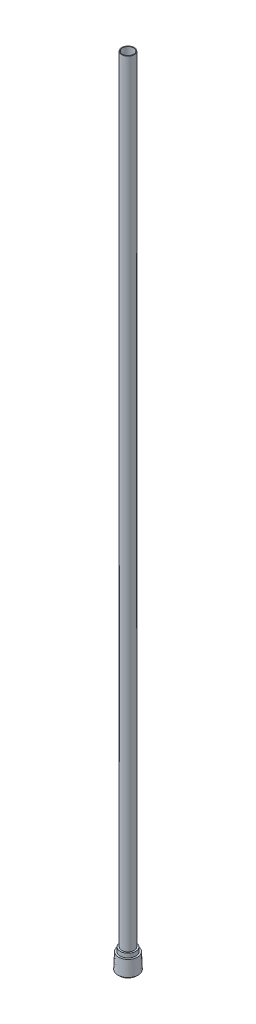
ISO-10303-21;
HEADER;
FILE_DESCRIPTION(('STEP AP214'),'2;1');
FILE_NAME('part.step','',(''),(''),'','','');
FILE_SCHEMA(('AUTOMOTIVE_DESIGN { 1 0 10303 214 1 1 1 1 }'));
ENDSEC;
DATA;
#1=APPLICATION_CONTEXT('core data for automotive mechanical design processes');
#2=APPLICATION_PROTOCOL_DEFINITION('international standard','automotive_design',2000,#1);
#3=PRODUCT_CONTEXT('',#1,'mechanical');
#4=PRODUCT('Part','Part','',(#3));
#5=PRODUCT_RELATED_PRODUCT_CATEGORY('part','',(#4));
#6=PRODUCT_DEFINITION_FORMATION('','',#4);
#7=PRODUCT_DEFINITION_CONTEXT('part definition',#1,'design');
#8=PRODUCT_DEFINITION('design','',#6,#7);
#9=PRODUCT_DEFINITION_SHAPE('','',#8);
#10=(LENGTH_UNIT() NAMED_UNIT(*) SI_UNIT(.MILLI.,.METRE.));
#11=(NAMED_UNIT(*) PLANE_ANGLE_UNIT() SI_UNIT($,.RADIAN.));
#12=(NAMED_UNIT(*) SI_UNIT($,.STERADIAN.) SOLID_ANGLE_UNIT());
#13=UNCERTAINTY_MEASURE_WITH_UNIT(LENGTH_MEASURE(1.E-05),#10,'distance_accuracy_value','');
#14=(GEOMETRIC_REPRESENTATION_CONTEXT(3) GLOBAL_UNCERTAINTY_ASSIGNED_CONTEXT((#13)) GLOBAL_UNIT_ASSIGNED_CONTEXT((#10,
#11,#12)) REPRESENTATION_CONTEXT('',''));
#15=CARTESIAN_POINT('',(0.,0.,0.));
#16=DIRECTION('',(0.,0.,1.));
#17=DIRECTION('',(1.,0.,0.));
#18=AXIS2_PLACEMENT_3D('',#15,#16,#17);
#19=CARTESIAN_POINT('',(0.,3.96240000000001,2.28769270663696));
#20=DIRECTION('',(0.,-1.,0.));
#21=DIRECTION('',(0.,0.,-1.));
#22=AXIS2_PLACEMENT_3D('',#19,#20,#21);
#23=PLANE('',#22);
#24=DIRECTION('',(0.866025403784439,0.,-0.5));
#25=VECTOR('',#24,1.);
#26=CARTESIAN_POINT('',(-1.9812,3.9624,-1.1438463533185));
#27=LINE('',#26,#25);
#28=CARTESIAN_POINT('',(-1.9812,3.9624,-1.1438463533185));
#29=VERTEX_POINT('',#28);
#30=CARTESIAN_POINT('',(-1.64618945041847,3.9624,-1.33726478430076));
#31=VERTEX_POINT('',#30);
#32=EDGE_CURVE('E143',#29,#31,#27,.T.);
#33=ORIENTED_EDGE('',*,*,#32,.T.);
#34=CARTESIAN_POINT('',(0.,3.9624,0.));
#35=DIRECTION('',(0.,-1.,0.));
#36=DIRECTION('',(0.,0.,-1.));
#37=AXIS2_PLACEMENT_3D('',#34,#35,#36);
#38=CIRCLE('',#37,2.1209);
#39=CARTESIAN_POINT('',(-1.9812,3.9624,-0.75700949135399));
#40=VERTEX_POINT('',#39);
#41=EDGE_CURVE('E124',#31,#40,#38,.F.);
#42=ORIENTED_EDGE('',*,*,#41,.T.);
#43=DIRECTION('',(0.,0.,-1.));
#44=VECTOR('',#43,1.);
#45=CARTESIAN_POINT('',(-1.9812,3.9624,1.14384635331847));
#46=LINE('',#45,#44);
#47=EDGE_CURVE('E147',#40,#29,#46,.T.);
#48=ORIENTED_EDGE('',*,*,#47,.T.);
#49=EDGE_LOOP('',(#33,#42,#48));
#50=FACE_BOUND('',#49,.T.);
#51=ADVANCED_FACE('F34',(#50),#23,.T.);
#52=CARTESIAN_POINT('',(-1.9812,3.9624,1.14384635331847));
#53=VERTEX_POINT('',#52);
#54=CARTESIAN_POINT('',(-1.9812,3.9624,0.75700949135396));
#55=VERTEX_POINT('',#54);
#56=EDGE_CURVE('E154',#53,#55,#46,.T.);
#57=ORIENTED_EDGE('',*,*,#56,.T.);
#58=CARTESIAN_POINT('',(-1.64618945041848,3.9624,1.33726478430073));
#59=VERTEX_POINT('',#58);
#60=EDGE_CURVE('E523',#55,#59,#38,.F.);
#61=ORIENTED_EDGE('',*,*,#60,.T.);
#62=DIRECTION('',(-0.866025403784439,0.,-0.5));
#63=VECTOR('',#62,1.);
#64=CARTESIAN_POINT('',(0.,3.96240000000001,2.28769270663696));
#65=LINE('',#64,#63);
#66=EDGE_CURVE('E166',#59,#53,#65,.T.);
#67=ORIENTED_EDGE('',*,*,#66,.T.);
#68=EDGE_LOOP('',(#57,#61,#67));
#69=FACE_BOUND('',#68,.T.);
#70=ADVANCED_FACE('F236',(#69),#23,.T.);
#71=CARTESIAN_POINT('',(0.,3.96240000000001,2.28769270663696));
#72=VERTEX_POINT('',#71);
#73=CARTESIAN_POINT('',(-0.33501054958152,3.96240000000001,2.0942742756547));
#74=VERTEX_POINT('',#73);
#75=EDGE_CURVE('E163',#72,#74,#65,.T.);
#76=ORIENTED_EDGE('',*,*,#75,.T.);
#77=CARTESIAN_POINT('',(0.33501054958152,3.96240000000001,2.0942742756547));
#78=VERTEX_POINT('',#77);
#79=EDGE_CURVE('E520',#74,#78,#38,.F.);
#80=ORIENTED_EDGE('',*,*,#79,.T.);
#81=DIRECTION('',(-0.866025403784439,0.,0.5));
#82=VECTOR('',#81,1.);
#83=CARTESIAN_POINT('',(1.9812,3.9624,1.14384635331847));
#84=LINE('',#83,#82);
#85=EDGE_CURVE('E176',#78,#72,#84,.T.);
#86=ORIENTED_EDGE('',*,*,#85,.T.);
#87=EDGE_LOOP('',(#76,#80,#86));
#88=FACE_BOUND('',#87,.T.);
#89=ADVANCED_FACE('F242',(#88),#23,.T.);
#90=CARTESIAN_POINT('',(1.9812,3.9624,1.14384635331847));
#91=VERTEX_POINT('',#90);
#92=CARTESIAN_POINT('',(1.64618945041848,3.9624,1.33726478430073));
#93=VERTEX_POINT('',#92);
#94=EDGE_CURVE('E171',#91,#93,#84,.T.);
#95=ORIENTED_EDGE('',*,*,#94,.T.);
#96=CARTESIAN_POINT('',(1.9812,3.9624,0.75700949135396));
#97=VERTEX_POINT('',#96);
#98=EDGE_CURVE('E288',#93,#97,#38,.F.);
#99=ORIENTED_EDGE('',*,*,#98,.T.);
#100=DIRECTION('',(0.,0.,1.));
#101=VECTOR('',#100,1.);
#102=CARTESIAN_POINT('',(1.9812,3.9624,-1.1438463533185));
#103=LINE('',#102,#101);
#104=EDGE_CURVE('E258',#97,#91,#103,.T.);
#105=ORIENTED_EDGE('',*,*,#104,.T.);
#106=EDGE_LOOP('',(#95,#99,#105));
#107=FACE_BOUND('',#106,.T.);
#108=ADVANCED_FACE('F253',(#107),#23,.T.);
#109=CARTESIAN_POINT('',(1.9812,3.9624,-1.1438463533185));
#110=VERTEX_POINT('',#109);
#111=CARTESIAN_POINT('',(1.9812,3.9624,-0.757009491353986));
#112=VERTEX_POINT('',#111);
#113=EDGE_CURVE('E206',#110,#112,#103,.T.);
#114=ORIENTED_EDGE('',*,*,#113,.T.);
#115=CARTESIAN_POINT('',(1.64618945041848,3.9624,-1.33726478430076));
#116=VERTEX_POINT('',#115);
#117=EDGE_CURVE('E282',#112,#116,#38,.F.);
#118=ORIENTED_EDGE('',*,*,#117,.T.);
#119=DIRECTION('',(0.866025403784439,0.,0.5));
#120=VECTOR('',#119,1.);
#121=CARTESIAN_POINT('',(0.,3.96239999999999,-2.28769270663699));
#122=LINE('',#121,#120);
#123=EDGE_CURVE('E149',#116,#110,#122,.T.);
#124=ORIENTED_EDGE('',*,*,#123,.T.);
#125=EDGE_LOOP('',(#114,#118,#124));
#126=FACE_BOUND('',#125,.T.);
#127=ADVANCED_FACE('F247',(#126),#23,.T.);
#128=CARTESIAN_POINT('',(0.,3.96239999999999,-2.28769270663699));
#129=VERTEX_POINT('',#128);
#130=CARTESIAN_POINT('',(0.335010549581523,3.96239999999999,-2.09427427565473));
#131=VERTEX_POINT('',#130);
#132=EDGE_CURVE('E152',#129,#131,#122,.T.);
#133=ORIENTED_EDGE('',*,*,#132,.T.);
#134=CARTESIAN_POINT('',(-0.335010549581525,3.96239999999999,-2.09427427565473));
#135=VERTEX_POINT('',#134);
#136=EDGE_CURVE('E137',#131,#135,#38,.F.);
#137=ORIENTED_EDGE('',*,*,#136,.T.);
#138=EDGE_CURVE('E145',#135,#129,#27,.T.);
#139=ORIENTED_EDGE('',*,*,#138,.T.);
#140=EDGE_LOOP('',(#133,#137,#139));
#141=FACE_BOUND('',#140,.T.);
#142=ADVANCED_FACE('F238',(#141),#23,.T.);
#143=CARTESIAN_POINT('',(0.,0.,0.));
#144=DIRECTION('',(0.,1.,0.));
#145=DIRECTION('',(0.,0.,1.));
#146=AXIS2_PLACEMENT_3D('',#143,#144,#145);
#147=PLANE('',#146);
#148=CARTESIAN_POINT('',(0.,0.,0.));
#149=DIRECTION('',(0.,1.,0.));
#150=DIRECTION('',(0.,0.,1.));
#151=AXIS2_PLACEMENT_3D('',#148,#149,#150);
#152=CIRCLE('',#151,3.3909);
#153=CARTESIAN_POINT('',(0.,0.,3.3909));
#154=VERTEX_POINT('',#153);
#155=EDGE_CURVE('E11',#154,#154,#152,.F.);
#156=ORIENTED_EDGE('',*,*,#155,.T.);
#157=EDGE_LOOP('',(#156));
#158=FACE_BOUND('',#157,.T.);
#159=DIRECTION('',(-0.866025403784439,0.,-0.5));
#160=VECTOR('',#159,1.);
#161=CARTESIAN_POINT('',(0.,0.,2.28769270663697));
#162=LINE('',#161,#160);
#163=CARTESIAN_POINT('',(0.,0.,2.28769270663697));
#164=VERTEX_POINT('',#163);
#165=CARTESIAN_POINT('',(-1.9812,0.,1.14384635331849));
#166=VERTEX_POINT('',#165);
#167=EDGE_CURVE('E264',#164,#166,#162,.T.);
#168=ORIENTED_EDGE('',*,*,#167,.F.);
#169=DIRECTION('',(-0.866025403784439,0.,0.5));
#170=VECTOR('',#169,1.);
#171=CARTESIAN_POINT('',(1.9812,0.,1.14384635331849));
#172=LINE('',#171,#170);
#173=CARTESIAN_POINT('',(1.9812,0.,1.14384635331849));
#174=VERTEX_POINT('',#173);
#175=EDGE_CURVE('E58',#174,#164,#172,.T.);
#176=ORIENTED_EDGE('',*,*,#175,.F.);
#177=DIRECTION('',(0.,0.,1.));
#178=VECTOR('',#177,1.);
#179=CARTESIAN_POINT('',(1.9812,0.,-1.14384635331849));
#180=LINE('',#179,#178);
#181=CARTESIAN_POINT('',(1.9812,0.,-1.14384635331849));
#182=VERTEX_POINT('',#181);
#183=EDGE_CURVE('E180',#182,#174,#180,.T.);
#184=ORIENTED_EDGE('',*,*,#183,.F.);
#185=DIRECTION('',(0.866025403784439,0.,0.5));
#186=VECTOR('',#185,1.);
#187=CARTESIAN_POINT('',(0.,0.,-2.28769270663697));
#188=LINE('',#187,#186);
#189=CARTESIAN_POINT('',(0.,0.,-2.28769270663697));
#190=VERTEX_POINT('',#189);
#191=EDGE_CURVE('E183',#190,#182,#188,.T.);
#192=ORIENTED_EDGE('',*,*,#191,.F.);
#193=DIRECTION('',(0.866025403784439,0.,-0.5));
#194=VECTOR('',#193,1.);
#195=CARTESIAN_POINT('',(-1.9812,0.,-1.14384635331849));
#196=LINE('',#195,#194);
#197=CARTESIAN_POINT('',(-1.9812,0.,-1.14384635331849));
#198=VERTEX_POINT('',#197);
#199=EDGE_CURVE('E189',#198,#190,#196,.T.);
#200=ORIENTED_EDGE('',*,*,#199,.F.);
#201=DIRECTION('',(0.,0.,-1.));
#202=VECTOR('',#201,1.);
#203=CARTESIAN_POINT('',(-1.9812,0.,1.14384635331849));
#204=LINE('',#203,#202);
#205=EDGE_CURVE('E267',#166,#198,#204,.T.);
#206=ORIENTED_EDGE('',*,*,#205,.F.);
#207=EDGE_LOOP('',(#168,#176,#184,#192,#200,#206));
#208=FACE_BOUND('',#207,.T.);
#209=ADVANCED_FACE('F246',(#158,#208),#147,.F.);
#210=CARTESIAN_POINT('',(0.,0.,0.));
#211=DIRECTION('',(0.,-1.,0.));
#212=DIRECTION('',(0.,0.,-1.));
#213=AXIS2_PLACEMENT_3D('',#210,#211,#212);
#214=CONICAL_SURFACE('',#213,3.8989,0.0364424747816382);
#215=CARTESIAN_POINT('',(0.,0.490130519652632,0.));
#216=DIRECTION('',(0.,1.,0.));
#217=DIRECTION('',(0.,0.,1.));
#218=AXIS2_PLACEMENT_3D('',#215,#216,#217);
#219=CIRCLE('',#218,3.88103051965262);
#220=CARTESIAN_POINT('',(0.,0.490130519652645,3.88103051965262));
#221=VERTEX_POINT('',#220);
#222=EDGE_CURVE('E43',#221,#221,#219,.T.);
#223=ORIENTED_EDGE('',*,*,#222,.T.);
#224=EDGE_LOOP('',(#223));
#225=FACE_BOUND('',#224,.T.);
#226=CARTESIAN_POINT('',(0.,6.35000000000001,0.));
#227=DIRECTION('',(0.,1.,0.));
#228=DIRECTION('',(0.,0.,1.));
#229=AXIS2_PLACEMENT_3D('',#226,#227,#228);
#230=CIRCLE('',#229,3.66738778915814);
#231=CARTESIAN_POINT('',(0.,6.35000000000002,3.66738778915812));
#232=VERTEX_POINT('',#231);
#233=EDGE_CURVE('E218',#232,#232,#230,.T.);
#234=ORIENTED_EDGE('',*,*,#233,.F.);
#235=EDGE_LOOP('',(#234));
#236=FACE_BOUND('',#235,.T.);
#237=ADVANCED_FACE('F223',(#225,#236),#214,.T.);
#238=CARTESIAN_POINT('',(0.,6.35,-3.66738778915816));
#239=DIRECTION('',(0.,-1.,0.));
#240=DIRECTION('',(0.,0.,-1.));
#241=AXIS2_PLACEMENT_3D('',#238,#239,#240);
#242=PLANE('',#241);
#243=CARTESIAN_POINT('',(0.,6.35000000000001,0.));
#244=DIRECTION('',(0.,1.,0.));
#245=DIRECTION('',(0.,0.,1.));
#246=AXIS2_PLACEMENT_3D('',#243,#244,#245);
#247=CIRCLE('',#246,2.98449999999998);
#248=CARTESIAN_POINT('',(0.,6.35000000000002,2.98449999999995));
#249=VERTEX_POINT('',#248);
#250=EDGE_CURVE('E215',#249,#249,#247,.T.);
#251=ORIENTED_EDGE('',*,*,#250,.F.);
#252=EDGE_LOOP('',(#251));
#253=FACE_BOUND('',#252,.T.);
#254=ORIENTED_EDGE('',*,*,#233,.T.);
#255=EDGE_LOOP('',(#254));
#256=FACE_BOUND('',#255,.T.);
#257=ADVANCED_FACE('F317',(#253,#256),#242,.F.);
#258=CARTESIAN_POINT('',(0.,0.,0.));
#259=DIRECTION('',(0.,1.,0.));
#260=DIRECTION('',(0.,0.,1.));
#261=AXIS2_PLACEMENT_3D('',#258,#259,#260);
#262=CYLINDRICAL_SURFACE('',#261,2.98449999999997);
#263=CARTESIAN_POINT('',(0.,7.92480000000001,0.));
#264=DIRECTION('',(0.,1.,0.));
#265=DIRECTION('',(0.,0.,1.));
#266=AXIS2_PLACEMENT_3D('',#263,#264,#265);
#267=CIRCLE('',#266,2.98449999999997);
#268=CARTESIAN_POINT('',(0.,7.92480000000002,2.98449999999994));
#269=VERTEX_POINT('',#268);
#270=EDGE_CURVE('E212',#269,#269,#267,.T.);
#271=ORIENTED_EDGE('',*,*,#270,.F.);
#272=EDGE_LOOP('',(#271));
#273=FACE_BOUND('',#272,.T.);
#274=ORIENTED_EDGE('',*,*,#250,.T.);
#275=EDGE_LOOP('',(#274));
#276=FACE_BOUND('',#275,.T.);
#277=ADVANCED_FACE('F311',(#273,#276),#262,.T.);
#278=CARTESIAN_POINT('',(0.,7.9248,-2.9845));
#279=DIRECTION('',(0.,-1.,0.));
#280=DIRECTION('',(0.,0.,-1.));
#281=AXIS2_PLACEMENT_3D('',#278,#279,#280);
#282=PLANE('',#281);
#283=CARTESIAN_POINT('',(0.,7.92480000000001,0.));
#284=DIRECTION('',(0.,1.,0.));
#285=DIRECTION('',(0.,0.,1.));
#286=AXIS2_PLACEMENT_3D('',#283,#284,#285);
#287=CIRCLE('',#286,2.37489999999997);
#288=CARTESIAN_POINT('',(0.,7.92480000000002,2.37489999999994));
#289=VERTEX_POINT('',#288);
#290=EDGE_CURVE('E209',#289,#289,#287,.T.);
#291=ORIENTED_EDGE('',*,*,#290,.F.);
#292=EDGE_LOOP('',(#291));
#293=FACE_BOUND('',#292,.T.);
#294=ORIENTED_EDGE('',*,*,#270,.T.);
#295=EDGE_LOOP('',(#294));
#296=FACE_BOUND('',#295,.T.);
#297=ADVANCED_FACE('F305',(#293,#296),#282,.F.);
#298=CARTESIAN_POINT('',(0.,0.,0.));
#299=DIRECTION('',(0.,1.,0.));
#300=DIRECTION('',(0.,0.,1.));
#301=AXIS2_PLACEMENT_3D('',#298,#299,#300);
#302=CYLINDRICAL_SURFACE('',#301,2.37489999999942);
#303=CARTESIAN_POINT('',(0.,304.8,-1.06420362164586E-12));
#304=DIRECTION('',(0.,1.,0.));
#305=DIRECTION('',(0.,0.,1.));
#306=AXIS2_PLACEMENT_3D('',#303,#304,#305);
#307=CIRCLE('',#306,2.37489999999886);
#308=CARTESIAN_POINT('',(0.,304.8,2.3748999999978));
#309=VERTEX_POINT('',#308);
#310=EDGE_CURVE('E195',#309,#309,#307,.T.);
#311=ORIENTED_EDGE('',*,*,#310,.F.);
#312=EDGE_LOOP('',(#311));
#313=FACE_BOUND('',#312,.T.);
#314=ORIENTED_EDGE('',*,*,#290,.T.);
#315=EDGE_LOOP('',(#314));
#316=FACE_BOUND('',#315,.T.);
#317=ADVANCED_FACE('F299',(#313,#316),#302,.T.);
#318=CARTESIAN_POINT('',(0.,304.8,-2.37489999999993));
#319=DIRECTION('',(0.,-1.,0.));
#320=DIRECTION('',(0.,0.,-1.));
#321=AXIS2_PLACEMENT_3D('',#318,#319,#320);
#322=PLANE('',#321);
#323=CARTESIAN_POINT('',(0.,304.8,-1.06420362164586E-12));
#324=DIRECTION('',(0.,1.,0.));
#325=DIRECTION('',(0.,0.,1.));
#326=AXIS2_PLACEMENT_3D('',#323,#324,#325);
#327=CIRCLE('',#326,2.1209);
#328=CARTESIAN_POINT('',(0.,304.8,2.12089999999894));
#329=VERTEX_POINT('',#328);
#330=EDGE_CURVE('E291',#329,#329,#327,.T.);
#331=ORIENTED_EDGE('',*,*,#330,.F.);
#332=EDGE_LOOP('',(#331));
#333=FACE_BOUND('',#332,.T.);
#334=ORIENTED_EDGE('',*,*,#310,.T.);
#335=EDGE_LOOP('',(#334));
#336=FACE_BOUND('',#335,.T.);
#337=ADVANCED_FACE('F295',(#333,#336),#322,.F.);
#338=CARTESIAN_POINT('',(1.9812,3.9624,1.14384635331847));
#339=DIRECTION('',(0.5,0.,0.866025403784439));
#340=DIRECTION('',(0.866025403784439,0.,-0.5));
#341=AXIS2_PLACEMENT_3D('',#338,#339,#340);
#342=PLANE('',#341);
#343=ORIENTED_EDGE('',*,*,#175,.T.);
#344=DIRECTION('',(0.,-1.,0.));
#345=VECTOR('',#344,1.);
#346=CARTESIAN_POINT('',(0.,3.96240000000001,2.28769270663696));
#347=LINE('',#346,#345);
#348=EDGE_CURVE('E204',#72,#164,#347,.T.);
#349=ORIENTED_EDGE('',*,*,#348,.F.);
#350=ORIENTED_EDGE('',*,*,#85,.F.);
#351=EDGE_CURVE('E175',#93,#78,#84,.T.);
#352=ORIENTED_EDGE('',*,*,#351,.F.);
#353=ORIENTED_EDGE('',*,*,#94,.F.);
#354=DIRECTION('',(0.,-1.,0.));
#355=VECTOR('',#354,1.);
#356=CARTESIAN_POINT('',(1.9812,3.9624,1.14384635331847));
#357=LINE('',#356,#355);
#358=EDGE_CURVE('E193',#91,#174,#357,.T.);
#359=ORIENTED_EDGE('',*,*,#358,.T.);
#360=EDGE_LOOP('',(#343,#349,#350,#352,#353,#359));
#361=FACE_BOUND('',#360,.T.);
#362=ADVANCED_FACE('F298',(#361),#342,.F.);
#363=CARTESIAN_POINT('',(1.9812,3.9624,-1.1438463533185));
#364=DIRECTION('',(1.,0.,0.));
#365=DIRECTION('',(0.,0.,-1.));
#366=AXIS2_PLACEMENT_3D('',#363,#364,#365);
#367=PLANE('',#366);
#368=ORIENTED_EDGE('',*,*,#183,.T.);
#369=ORIENTED_EDGE('',*,*,#358,.F.);
#370=ORIENTED_EDGE('',*,*,#104,.F.);
#371=EDGE_CURVE('E259',#112,#97,#103,.T.);
#372=ORIENTED_EDGE('',*,*,#371,.F.);
#373=ORIENTED_EDGE('',*,*,#113,.F.);
#374=DIRECTION('',(0.,-1.,0.));
#375=VECTOR('',#374,1.);
#376=CARTESIAN_POINT('',(1.9812,3.9624,-1.1438463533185));
#377=LINE('',#376,#375);
#378=EDGE_CURVE('E196',#110,#182,#377,.T.);
#379=ORIENTED_EDGE('',*,*,#378,.T.);
#380=EDGE_LOOP('',(#368,#369,#370,#372,#373,#379));
#381=FACE_BOUND('',#380,.T.);
#382=ADVANCED_FACE('F279',(#381),#367,.F.);
#383=CARTESIAN_POINT('',(0.,3.96239999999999,-2.28769270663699));
#384=DIRECTION('',(0.5,0.,-0.866025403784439));
#385=DIRECTION('',(-0.866025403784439,0.,-0.5));
#386=AXIS2_PLACEMENT_3D('',#383,#384,#385);
#387=PLANE('',#386);
#388=ORIENTED_EDGE('',*,*,#191,.T.);
#389=ORIENTED_EDGE('',*,*,#378,.F.);
#390=ORIENTED_EDGE('',*,*,#123,.F.);
#391=EDGE_CURVE('E150',#131,#116,#122,.T.);
#392=ORIENTED_EDGE('',*,*,#391,.F.);
#393=ORIENTED_EDGE('',*,*,#132,.F.);
#394=DIRECTION('',(0.,-1.,0.));
#395=VECTOR('',#394,1.);
#396=CARTESIAN_POINT('',(0.,3.96239999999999,-2.28769270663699));
#397=LINE('',#396,#395);
#398=EDGE_CURVE('E198',#129,#190,#397,.T.);
#399=ORIENTED_EDGE('',*,*,#398,.T.);
#400=EDGE_LOOP('',(#388,#389,#390,#392,#393,#399));
#401=FACE_BOUND('',#400,.T.);
#402=ADVANCED_FACE('F275',(#401),#387,.F.);
#403=CARTESIAN_POINT('',(-1.9812,3.9624,-1.1438463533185));
#404=DIRECTION('',(-0.5,0.,-0.866025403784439));
#405=DIRECTION('',(-0.866025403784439,0.,0.5));
#406=AXIS2_PLACEMENT_3D('',#403,#404,#405);
#407=PLANE('',#406);
#408=ORIENTED_EDGE('',*,*,#199,.T.);
#409=ORIENTED_EDGE('',*,*,#398,.F.);
#410=ORIENTED_EDGE('',*,*,#138,.F.);
#411=EDGE_CURVE('E135',#31,#135,#27,.T.);
#412=ORIENTED_EDGE('',*,*,#411,.F.);
#413=ORIENTED_EDGE('',*,*,#32,.F.);
#414=DIRECTION('',(0.,-1.,0.));
#415=VECTOR('',#414,1.);
#416=CARTESIAN_POINT('',(-1.9812,3.9624,-1.1438463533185));
#417=LINE('',#416,#415);
#418=EDGE_CURVE('E200',#29,#198,#417,.T.);
#419=ORIENTED_EDGE('',*,*,#418,.T.);
#420=EDGE_LOOP('',(#408,#409,#410,#412,#413,#419));
#421=FACE_BOUND('',#420,.T.);
#422=ADVANCED_FACE('F142',(#421),#407,.F.);
#423=CARTESIAN_POINT('',(-1.9812,3.9624,1.14384635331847));
#424=DIRECTION('',(-1.,0.,0.));
#425=DIRECTION('',(0.,0.,1.));
#426=AXIS2_PLACEMENT_3D('',#423,#424,#425);
#427=PLANE('',#426);
#428=ORIENTED_EDGE('',*,*,#205,.T.);
#429=ORIENTED_EDGE('',*,*,#418,.F.);
#430=ORIENTED_EDGE('',*,*,#47,.F.);
#431=EDGE_CURVE('E158',#55,#40,#46,.T.);
#432=ORIENTED_EDGE('',*,*,#431,.F.);
#433=ORIENTED_EDGE('',*,*,#56,.F.);
#434=DIRECTION('',(0.,-1.,0.));
#435=VECTOR('',#434,1.);
#436=CARTESIAN_POINT('',(-1.9812,3.9624,1.14384635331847));
#437=LINE('',#436,#435);
#438=EDGE_CURVE('E202',#53,#166,#437,.T.);
#439=ORIENTED_EDGE('',*,*,#438,.T.);
#440=EDGE_LOOP('',(#428,#429,#430,#432,#433,#439));
#441=FACE_BOUND('',#440,.T.);
#442=ADVANCED_FACE('F336',(#441),#427,.F.);
#443=CARTESIAN_POINT('',(0.,3.96240000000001,2.28769270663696));
#444=DIRECTION('',(-0.5,0.,0.866025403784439));
#445=DIRECTION('',(0.866025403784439,0.,0.5));
#446=AXIS2_PLACEMENT_3D('',#443,#444,#445);
#447=PLANE('',#446);
#448=ORIENTED_EDGE('',*,*,#167,.T.);
#449=ORIENTED_EDGE('',*,*,#438,.F.);
#450=ORIENTED_EDGE('',*,*,#66,.F.);
#451=EDGE_CURVE('E165',#74,#59,#65,.T.);
#452=ORIENTED_EDGE('',*,*,#451,.F.);
#453=ORIENTED_EDGE('',*,*,#75,.F.);
#454=ORIENTED_EDGE('',*,*,#348,.T.);
#455=EDGE_LOOP('',(#448,#449,#450,#452,#453,#454));
#456=FACE_BOUND('',#455,.T.);
#457=ADVANCED_FACE('F332',(#456),#447,.F.);
#458=CARTESIAN_POINT('',(0.,3.96240000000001,2.28769270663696));
#459=DIRECTION('',(0.,-1.,0.));
#460=DIRECTION('',(0.,0.,-1.));
#461=AXIS2_PLACEMENT_3D('',#458,#459,#460);
#462=PLANE('',#461);
#463=ORIENTED_EDGE('',*,*,#351,.T.);
#464=EDGE_CURVE('E517',#78,#93,#38,.F.);
#465=ORIENTED_EDGE('',*,*,#464,.T.);
#466=EDGE_LOOP('',(#463,#465));
#467=FACE_BOUND('',#466,.T.);
#468=ADVANCED_FACE('F335',(#467),#462,.F.);
#469=ORIENTED_EDGE('',*,*,#451,.T.);
#470=EDGE_CURVE('E522',#59,#74,#38,.F.);
#471=ORIENTED_EDGE('',*,*,#470,.T.);
#472=EDGE_LOOP('',(#469,#471));
#473=FACE_BOUND('',#472,.T.);
#474=ADVANCED_FACE('F371',(#473),#462,.F.);
#475=ORIENTED_EDGE('',*,*,#431,.T.);
#476=EDGE_CURVE('E127',#40,#55,#38,.F.);
#477=ORIENTED_EDGE('',*,*,#476,.T.);
#478=EDGE_LOOP('',(#475,#477));
#479=FACE_BOUND('',#478,.T.);
#480=ADVANCED_FACE('F378',(#479),#462,.F.);
#481=ORIENTED_EDGE('',*,*,#411,.T.);
#482=EDGE_CURVE('E50',#135,#31,#38,.F.);
#483=ORIENTED_EDGE('',*,*,#482,.T.);
#484=EDGE_LOOP('',(#481,#483));
#485=FACE_BOUND('',#484,.T.);
#486=ADVANCED_FACE('F134',(#485),#462,.F.);
#487=ORIENTED_EDGE('',*,*,#391,.T.);
#488=EDGE_CURVE('E287',#116,#131,#38,.F.);
#489=ORIENTED_EDGE('',*,*,#488,.T.);
#490=EDGE_LOOP('',(#487,#489));
#491=FACE_BOUND('',#490,.T.);
#492=ADVANCED_FACE('F391',(#491),#462,.F.);
#493=ORIENTED_EDGE('',*,*,#371,.T.);
#494=EDGE_CURVE('E286',#97,#112,#38,.F.);
#495=ORIENTED_EDGE('',*,*,#494,.T.);
#496=EDGE_LOOP('',(#493,#495));
#497=FACE_BOUND('',#496,.T.);
#498=ADVANCED_FACE('F231',(#497),#462,.F.);
#499=CARTESIAN_POINT('',(0.,-2.0364110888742,0.));
#500=DIRECTION('',(0.,1.,0.));
#501=DIRECTION('',(0.,0.,1.));
#502=AXIS2_PLACEMENT_3D('',#499,#500,#501);
#503=CYLINDRICAL_SURFACE('',#502,2.1209);
#504=ORIENTED_EDGE('',*,*,#330,.T.);
#505=EDGE_LOOP('',(#504));
#506=FACE_BOUND('',#505,.T.);
#507=ORIENTED_EDGE('',*,*,#482,.F.);
#508=ORIENTED_EDGE('',*,*,#136,.F.);
#509=ORIENTED_EDGE('',*,*,#488,.F.);
#510=ORIENTED_EDGE('',*,*,#117,.F.);
#511=ORIENTED_EDGE('',*,*,#494,.F.);
#512=ORIENTED_EDGE('',*,*,#98,.F.);
#513=ORIENTED_EDGE('',*,*,#464,.F.);
#514=ORIENTED_EDGE('',*,*,#79,.F.);
#515=ORIENTED_EDGE('',*,*,#470,.F.);
#516=ORIENTED_EDGE('',*,*,#60,.F.);
#517=ORIENTED_EDGE('',*,*,#476,.F.);
#518=ORIENTED_EDGE('',*,*,#41,.F.);
#519=EDGE_LOOP('',(#507,#508,#509,#510,#511,#512,#513,#514,#515,#516,#517,#518));
#520=FACE_BOUND('',#519,.T.);
#521=ADVANCED_FACE('F125',(#506,#520),#503,.F.);
#522=CARTESIAN_POINT('',(0.,0.490130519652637,0.));
#523=DIRECTION('',(0.,1.,0.));
#524=DIRECTION('',(0.,0.,1.));
#525=AXIS2_PLACEMENT_3D('',#522,#523,#524);
#526=CONICAL_SURFACE('',#525,3.88103051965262,0.78539816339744);
#527=ORIENTED_EDGE('',*,*,#155,.F.);
#528=EDGE_LOOP('',(#527));
#529=FACE_BOUND('',#528,.T.);
#530=ORIENTED_EDGE('',*,*,#222,.F.);
#531=EDGE_LOOP('',(#530));
#532=FACE_BOUND('',#531,.T.);
#533=ADVANCED_FACE('F37',(#529,#532),#526,.T.);
#534=CLOSED_SHELL('',(#51,#70,#89,#108,#127,#142,#209,#237,#257,#277,#297,#317,#337,#362,#382,
#402,#422,#442,#457,#468,#474,#480,#486,#492,#498,#521,#533));
#535=MANIFOLD_SOLID_BREP('B2',#534);
#536=ADVANCED_BREP_SHAPE_REPRESENTATION('',(#18,#535),#14);
#537=SHAPE_DEFINITION_REPRESENTATION(#9,#536);
ENDSEC;
END-ISO-10303-21;
